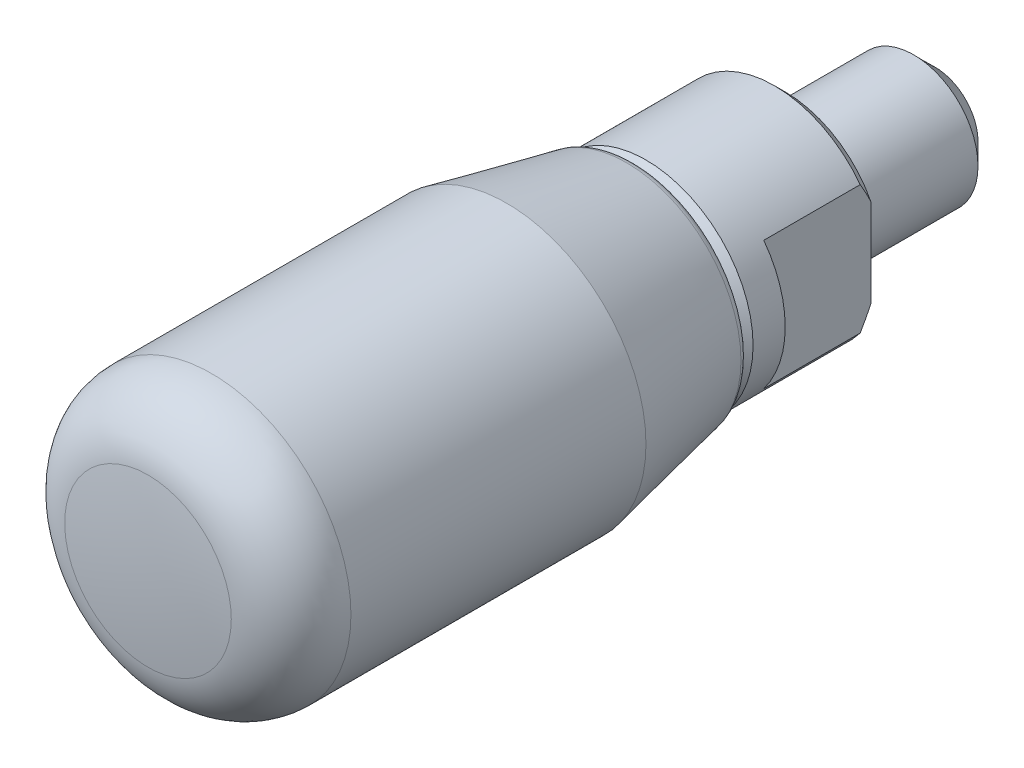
ISO-10303-21;
HEADER;
FILE_DESCRIPTION(('STEP AP214'),'2;1');
FILE_NAME('part.step','',(''),(''),'','','');
FILE_SCHEMA(('AUTOMOTIVE_DESIGN { 1 0 10303 214 1 1 1 1 }'));
ENDSEC;
DATA;
#1=APPLICATION_CONTEXT('core data for automotive mechanical design processes');
#2=APPLICATION_PROTOCOL_DEFINITION('international standard','automotive_design',2000,#1);
#3=PRODUCT_CONTEXT('',#1,'mechanical');
#4=PRODUCT('Part','Part','',(#3));
#5=PRODUCT_RELATED_PRODUCT_CATEGORY('part','',(#4));
#6=PRODUCT_DEFINITION_FORMATION('','',#4);
#7=PRODUCT_DEFINITION_CONTEXT('part definition',#1,'design');
#8=PRODUCT_DEFINITION('design','',#6,#7);
#9=PRODUCT_DEFINITION_SHAPE('','',#8);
#10=(LENGTH_UNIT() NAMED_UNIT(*) SI_UNIT(.MILLI.,.METRE.));
#11=(NAMED_UNIT(*) PLANE_ANGLE_UNIT() SI_UNIT($,.RADIAN.));
#12=(NAMED_UNIT(*) SI_UNIT($,.STERADIAN.) SOLID_ANGLE_UNIT());
#13=UNCERTAINTY_MEASURE_WITH_UNIT(LENGTH_MEASURE(1.E-05),#10,'distance_accuracy_value','');
#14=(GEOMETRIC_REPRESENTATION_CONTEXT(3) GLOBAL_UNCERTAINTY_ASSIGNED_CONTEXT((#13)) GLOBAL_UNIT_ASSIGNED_CONTEXT((#10,
#11,#12)) REPRESENTATION_CONTEXT('',''));
#15=CARTESIAN_POINT('',(0.,0.,0.));
#16=DIRECTION('',(0.,0.,1.));
#17=DIRECTION('',(1.,0.,0.));
#18=AXIS2_PLACEMENT_3D('',#15,#16,#17);
#19=CARTESIAN_POINT('',(0.,4.5,0.));
#20=DIRECTION('',(0.,0.,1.));
#21=DIRECTION('',(1.,0.,0.));
#22=AXIS2_PLACEMENT_3D('',#19,#20,#21);
#23=PLANE('',#22);
#24=CARTESIAN_POINT('',(0.,0.,0.));
#25=DIRECTION('',(0.,0.,1.));
#26=DIRECTION('',(1.,0.,0.));
#27=AXIS2_PLACEMENT_3D('',#24,#25,#26);
#28=CIRCLE('',#27,3.);
#29=CARTESIAN_POINT('',(3.,0.,0.));
#30=VERTEX_POINT('',#29);
#31=EDGE_CURVE('E92',#30,#30,#28,.T.);
#32=ORIENTED_EDGE('',*,*,#31,.T.);
#33=EDGE_LOOP('',(#32));
#34=FACE_BOUND('',#33,.T.);
#35=DIRECTION('',(0.,1.,0.));
#36=VECTOR('',#35,1.);
#37=CARTESIAN_POINT('',(-4.,3.,0.));
#38=LINE('',#37,#36);
#39=CARTESIAN_POINT('',(-4.,-2.06155281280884,0.));
#40=VERTEX_POINT('',#39);
#41=CARTESIAN_POINT('',(-4.,2.06155281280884,0.));
#42=VERTEX_POINT('',#41);
#43=EDGE_CURVE('E70',#40,#42,#38,.T.);
#44=ORIENTED_EDGE('',*,*,#43,.T.);
#45=CARTESIAN_POINT('',(0.,0.,0.));
#46=DIRECTION('',(0.,0.,1.));
#47=DIRECTION('',(1.,0.,0.));
#48=AXIS2_PLACEMENT_3D('',#45,#46,#47);
#49=CIRCLE('',#48,4.5);
#50=CARTESIAN_POINT('',(4.,2.06155281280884,0.));
#51=VERTEX_POINT('',#50);
#52=EDGE_CURVE('E95',#51,#42,#49,.T.);
#53=ORIENTED_EDGE('',*,*,#52,.F.);
#54=DIRECTION('',(0.,1.,0.));
#55=VECTOR('',#54,1.);
#56=CARTESIAN_POINT('',(4.,3.,0.));
#57=LINE('',#56,#55);
#58=CARTESIAN_POINT('',(4.,-2.06155281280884,0.));
#59=VERTEX_POINT('',#58);
#60=EDGE_CURVE('E132',#59,#51,#57,.T.);
#61=ORIENTED_EDGE('',*,*,#60,.F.);
#62=EDGE_CURVE('E98',#40,#59,#49,.T.);
#63=ORIENTED_EDGE('',*,*,#62,.F.);
#64=EDGE_LOOP('',(#44,#53,#61,#63));
#65=FACE_BOUND('',#64,.T.);
#66=ADVANCED_FACE('F14',(#34,#65),#23,.F.);
#67=CARTESIAN_POINT('',(0.,0.,0.));
#68=DIRECTION('',(0.,0.,1.));
#69=DIRECTION('',(1.,0.,0.));
#70=AXIS2_PLACEMENT_3D('',#67,#68,#69);
#71=CONICAL_SURFACE('',#70,4.5,0.785398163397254);
#72=CARTESIAN_POINT('',(-4.,6.61267837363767,3.22835786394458));
#73=CARTESIAN_POINT('',(-4.,6.5138484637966,3.14379764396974));
#74=CARTESIAN_POINT('',(-4.,6.41477027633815,3.05952756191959));
#75=CARTESIAN_POINT('',(-4.,6.21605204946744,2.89164873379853));
#76=CARTESIAN_POINT('',(-4.,6.11641199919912,2.8080400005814));
#77=CARTESIAN_POINT('',(-4.,5.81645670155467,2.55824890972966));
#78=CARTESIAN_POINT('',(-4.,5.61520522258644,2.39318656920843));
#79=CARTESIAN_POINT('',(-4.,5.2041444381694,2.06260458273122));
#80=CARTESIAN_POINT('',(-4.,4.99425007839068,1.89719028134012));
#81=CARTESIAN_POINT('',(-4.,4.5702423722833,1.57195226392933));
#82=CARTESIAN_POINT('',(-4.,4.35613010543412,1.41212714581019));
#83=CARTESIAN_POINT('',(-4.,3.92191769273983,1.09986985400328));
#84=CARTESIAN_POINT('',(-4.,3.70180729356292,0.947451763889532));
#85=CARTESIAN_POINT('',(-4.,3.36602267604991,0.727143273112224));
#86=CARTESIAN_POINT('',(-4.,3.25310127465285,0.655060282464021));
#87=CARTESIAN_POINT('',(-4.,3.025146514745,0.514324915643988));
#88=CARTESIAN_POINT('',(-4.,2.91011332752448,0.445672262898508));
#89=CARTESIAN_POINT('',(-4.,2.67874926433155,0.313189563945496));
#90=CARTESIAN_POINT('',(-4.,2.56244159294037,0.249319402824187));
#91=CARTESIAN_POINT('',(-4.,2.3271994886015,0.126638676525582));
#92=CARTESIAN_POINT('',(-4.,2.2082647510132,0.0678287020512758));
#93=CARTESIAN_POINT('',(-4.,1.84745293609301,-0.0991336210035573));
#94=CARTESIAN_POINT('',(-4.,1.60104963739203,-0.19812672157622));
#95=CARTESIAN_POINT('',(-4.,1.21869368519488,-0.320278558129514));
#96=CARTESIAN_POINT('',(-4.,1.08703991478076,-0.356945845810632));
#97=CARTESIAN_POINT('',(-4.,0.820997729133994,-0.418663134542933));
#98=CARTESIAN_POINT('',(-4.,0.686609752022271,-0.443714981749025));
#99=CARTESIAN_POINT('',(-4.,0.41663791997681,-0.48057112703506));
#100=CARTESIAN_POINT('',(-4.,0.281062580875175,-0.492436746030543));
#101=CARTESIAN_POINT('',(-4.,0.00940161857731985,-0.50229190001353));
#102=CARTESIAN_POINT('',(-4.,-0.126683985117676,-0.500281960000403));
#103=CARTESIAN_POINT('',(-4.,-0.397695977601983,-0.482550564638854));
#104=CARTESIAN_POINT('',(-4.,-0.532623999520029,-0.466853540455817));
#105=CARTESIAN_POINT('',(-4.,-0.800390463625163,-0.422848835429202));
#106=CARTESIAN_POINT('',(-4.,-0.9332285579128,-0.394539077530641));
#107=CARTESIAN_POINT('',(-4.,-1.19683850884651,-0.326742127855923));
#108=CARTESIAN_POINT('',(-4.,-1.3275928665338,-0.287187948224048));
#109=CARTESIAN_POINT('',(-4.,-1.58587707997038,-0.198805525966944));
#110=CARTESIAN_POINT('',(-4.,-1.71340705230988,-0.149977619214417));
#111=CARTESIAN_POINT('',(-4.,-2.00607339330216,-0.027712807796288));
#112=CARTESIAN_POINT('',(-4.,-2.17001221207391,0.0485725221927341));
#113=CARTESIAN_POINT('',(-4.,-2.49288824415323,0.211159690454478));
#114=CARTESIAN_POINT('',(-4.,-2.6518222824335,0.297467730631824));
#115=CARTESIAN_POINT('',(-4.,-2.96566951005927,0.477818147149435));
#116=CARTESIAN_POINT('',(-4.,-3.12057308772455,0.571877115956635));
#117=CARTESIAN_POINT('',(-4.,-3.42666836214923,0.765742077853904));
#118=CARTESIAN_POINT('',(-4.,-3.57786085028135,0.86554683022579));
#119=CARTESIAN_POINT('',(-4.,-3.87789023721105,1.07009325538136));
#120=CARTESIAN_POINT('',(-4.,-4.02671282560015,1.17485582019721));
#121=CARTESIAN_POINT('',(-4.,-4.32180408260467,1.38791783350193));
#122=CARTESIAN_POINT('',(-4.,-4.46807264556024,1.49621742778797));
#123=CARTESIAN_POINT('',(-4.,-4.75830471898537,1.71549986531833));
#124=CARTESIAN_POINT('',(-4.,-4.90227076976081,1.82647935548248));
#125=CARTESIAN_POINT('',(-4.,-5.18842229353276,2.05071313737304));
#126=CARTESIAN_POINT('',(-4.,-5.33060772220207,2.16396748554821));
#127=CARTESIAN_POINT('',(-4.,-5.66527129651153,2.4341347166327));
#128=CARTESIAN_POINT('',(-4.,-5.85710121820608,2.59184912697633));
#129=CARTESIAN_POINT('',(-4.,-6.2371217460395,2.90884826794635));
#130=CARTESIAN_POINT('',(-4.,-6.42532862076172,3.06811347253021));
#131=CARTESIAN_POINT('',(-4.,-6.61267837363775,3.2283578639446));
#132=B_SPLINE_CURVE_WITH_KNOTS('',3,(#72,#73,#74,#75,#76,#77,#78,#79,#80,#81,#82,#83,#84,#85,
#86,#87,#88,#89,#90,#91,#92,#93,#94,#95,#96,#97,#98,#99,#100,#101,#102,#103,#104,#105,#106,#107,
#108,#109,#110,#111,#112,#113,#114,#115,#116,#117,#118,#119,#120,#121,#122,#123,#124,#125,#126,
#127,#128,#129,#130,#131),.UNSPECIFIED.,.F.,.F.,(4,2,2,2,2,2,2,2,2,2,2,2,2,2,2,2,2,2,2,2,2,2,2,
2,2,2,2,2,2,4),(0.,0.39020422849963,0.780416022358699,1.56123065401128,2.36288213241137,
3.16433104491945,3.9672485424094,4.3691011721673,4.770921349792,5.16886742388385,
5.56685988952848,6.36104037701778,6.77061720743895,7.18012891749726,7.58772816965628,
7.99531199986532,8.40216978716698,8.80909460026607,9.21849635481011,9.62788328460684,
10.1698609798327,10.7121758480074,11.2556834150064,11.7990740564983,12.3450041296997,
12.8909567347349,13.4362584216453,13.9815736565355,14.7265631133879,15.4661801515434),.UNSPECIFIED.);
#133=CARTESIAN_POINT('',(-4.,3.,0.50000000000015));
#134=VERTEX_POINT('',#133);
#135=EDGE_CURVE('E322',#134,#42,#132,.T.);
#136=ORIENTED_EDGE('',*,*,#135,.F.);
#137=CARTESIAN_POINT('',(0.,0.,0.50000000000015));
#138=DIRECTION('',(0.,0.,1.));
#139=DIRECTION('',(1.,0.,0.));
#140=AXIS2_PLACEMENT_3D('',#137,#138,#139);
#141=CIRCLE('',#140,5.);
#142=CARTESIAN_POINT('',(4.,3.,0.50000000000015));
#143=VERTEX_POINT('',#142);
#144=EDGE_CURVE('E99',#143,#134,#141,.T.);
#145=ORIENTED_EDGE('',*,*,#144,.F.);
#146=CARTESIAN_POINT('',(4.,-6.61267837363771,3.22835786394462));
#147=CARTESIAN_POINT('',(4.,-6.51384846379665,3.14379764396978));
#148=CARTESIAN_POINT('',(4.,-6.4147702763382,3.05952756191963));
#149=CARTESIAN_POINT('',(4.,-6.21605204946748,2.89164873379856));
#150=CARTESIAN_POINT('',(4.,-6.11641199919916,2.80804000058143));
#151=CARTESIAN_POINT('',(4.,-5.81645670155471,2.55824890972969));
#152=CARTESIAN_POINT('',(4.,-5.61520522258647,2.39318656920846));
#153=CARTESIAN_POINT('',(4.,-5.20414443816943,2.06260458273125));
#154=CARTESIAN_POINT('',(4.,-4.99425007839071,1.89719028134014));
#155=CARTESIAN_POINT('',(4.,-4.57024237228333,1.57195226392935));
#156=CARTESIAN_POINT('',(4.,-4.35613010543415,1.41212714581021));
#157=CARTESIAN_POINT('',(4.,-3.92191769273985,1.0998698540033));
#158=CARTESIAN_POINT('',(4.,-3.70180729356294,0.947451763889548));
#159=CARTESIAN_POINT('',(4.,-3.36602267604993,0.727143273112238));
#160=CARTESIAN_POINT('',(4.,-3.25310127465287,0.655060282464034));
#161=CARTESIAN_POINT('',(4.,-3.02514651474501,0.514324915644));
#162=CARTESIAN_POINT('',(4.,-2.9101133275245,0.445672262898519));
#163=CARTESIAN_POINT('',(4.,-2.67874926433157,0.313189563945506));
#164=CARTESIAN_POINT('',(4.,-2.56244159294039,0.249319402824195));
#165=CARTESIAN_POINT('',(4.,-2.32719948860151,0.12663867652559));
#166=CARTESIAN_POINT('',(4.,-2.20826475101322,0.0678287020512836));
#167=CARTESIAN_POINT('',(4.,-1.84745293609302,-0.0991336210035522));
#168=CARTESIAN_POINT('',(4.,-1.60104963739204,-0.19812672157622));
#169=CARTESIAN_POINT('',(4.,-1.2186936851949,-0.320278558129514));
#170=CARTESIAN_POINT('',(4.,-1.08703991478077,-0.35694584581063));
#171=CARTESIAN_POINT('',(4.,-0.820997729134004,-0.41866313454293));
#172=CARTESIAN_POINT('',(4.,-0.686609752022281,-0.443714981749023));
#173=CARTESIAN_POINT('',(4.,-0.41663791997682,-0.480571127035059));
#174=CARTESIAN_POINT('',(4.,-0.281062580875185,-0.492436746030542));
#175=CARTESIAN_POINT('',(4.,-0.00940161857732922,-0.50229190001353));
#176=CARTESIAN_POINT('',(4.,0.126683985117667,-0.500281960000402));
#177=CARTESIAN_POINT('',(4.,0.397695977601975,-0.482550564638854));
#178=CARTESIAN_POINT('',(4.,0.532623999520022,-0.466853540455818));
#179=CARTESIAN_POINT('',(4.,0.800390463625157,-0.422848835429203));
#180=CARTESIAN_POINT('',(4.,0.933228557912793,-0.394539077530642));
#181=CARTESIAN_POINT('',(4.,1.19683850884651,-0.326742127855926));
#182=CARTESIAN_POINT('',(4.,1.32759286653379,-0.287187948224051));
#183=CARTESIAN_POINT('',(4.,1.58587707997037,-0.198805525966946));
#184=CARTESIAN_POINT('',(4.,1.71340705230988,-0.149977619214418));
#185=CARTESIAN_POINT('',(4.,2.00607339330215,-0.0277128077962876));
#186=CARTESIAN_POINT('',(4.,2.1700122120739,0.0485725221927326));
#187=CARTESIAN_POINT('',(4.,2.49288824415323,0.211159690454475));
#188=CARTESIAN_POINT('',(4.,2.6518222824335,0.297467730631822));
#189=CARTESIAN_POINT('',(4.,2.96566951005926,0.477818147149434));
#190=CARTESIAN_POINT('',(4.,3.12057308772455,0.571877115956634));
#191=CARTESIAN_POINT('',(4.,3.42666836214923,0.765742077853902));
#192=CARTESIAN_POINT('',(4.,3.57786085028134,0.865546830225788));
#193=CARTESIAN_POINT('',(4.,3.87789023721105,1.07009325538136));
#194=CARTESIAN_POINT('',(4.,4.02671282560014,1.1748558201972));
#195=CARTESIAN_POINT('',(4.,4.32180408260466,1.38791783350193));
#196=CARTESIAN_POINT('',(4.,4.46807264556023,1.49621742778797));
#197=CARTESIAN_POINT('',(4.,4.75830471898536,1.71549986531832));
#198=CARTESIAN_POINT('',(4.,4.9022707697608,1.82647935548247));
#199=CARTESIAN_POINT('',(4.,5.18842229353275,2.05071313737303));
#200=CARTESIAN_POINT('',(4.,5.33060772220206,2.16396748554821));
#201=CARTESIAN_POINT('',(4.,5.66527129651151,2.43413471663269));
#202=CARTESIAN_POINT('',(4.,5.85710121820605,2.59184912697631));
#203=CARTESIAN_POINT('',(4.,6.23712174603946,2.90884826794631));
#204=CARTESIAN_POINT('',(4.,6.42532862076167,3.06811347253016));
#205=CARTESIAN_POINT('',(4.,6.61267837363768,3.22835786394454));
#206=B_SPLINE_CURVE_WITH_KNOTS('',3,(#146,#147,#148,#149,#150,#151,#152,#153,#154,#155,#156,
#157,#158,#159,#160,#161,#162,#163,#164,#165,#166,#167,#168,#169,#170,#171,#172,#173,#174,#175,
#176,#177,#178,#179,#180,#181,#182,#183,#184,#185,#186,#187,#188,#189,#190,#191,#192,#193,#194,
#195,#196,#197,#198,#199,#200,#201,#202,#203,#204,#205),.UNSPECIFIED.,.F.,.F.,(4,2,2,2,2,2,2,2,
2,2,2,2,2,2,2,2,2,2,2,2,2,2,2,2,2,2,2,2,2,4),(0.,0.390204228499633,0.780416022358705,
1.56123065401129,2.36288213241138,3.16433104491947,3.96724854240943,4.36910117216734,
4.77092134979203,5.16886742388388,5.56685988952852,6.36104037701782,6.770617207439,
7.18012891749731,7.58772816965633,7.99531199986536,8.40216978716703,8.80909460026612,
9.21849635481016,9.62788328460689,10.1698609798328,10.7121758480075,11.2556834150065,
11.7990740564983,12.3450041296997,12.8909567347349,13.4362584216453,13.9815736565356,
14.7265631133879,15.4661801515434),.UNSPECIFIED.);
#207=EDGE_CURVE('E124',#51,#143,#206,.T.);
#208=ORIENTED_EDGE('',*,*,#207,.F.);
#209=ORIENTED_EDGE('',*,*,#52,.T.);
#210=EDGE_LOOP('',(#136,#145,#208,#209));
#211=FACE_BOUND('',#210,.T.);
#212=ADVANCED_FACE('F134',(#211),#71,.T.);
#213=CARTESIAN_POINT('',(-4.,-3.,0.50000000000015));
#214=VERTEX_POINT('',#213);
#215=EDGE_CURVE('E75',#40,#214,#132,.T.);
#216=ORIENTED_EDGE('',*,*,#215,.F.);
#217=ORIENTED_EDGE('',*,*,#62,.T.);
#218=CARTESIAN_POINT('',(4.,-3.,0.50000000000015));
#219=VERTEX_POINT('',#218);
#220=EDGE_CURVE('E123',#219,#59,#206,.T.);
#221=ORIENTED_EDGE('',*,*,#220,.F.);
#222=EDGE_CURVE('E101',#214,#219,#141,.T.);
#223=ORIENTED_EDGE('',*,*,#222,.F.);
#224=EDGE_LOOP('',(#216,#217,#221,#223));
#225=FACE_BOUND('',#224,.T.);
#226=ADVANCED_FACE('F173',(#225),#71,.T.);
#227=CARTESIAN_POINT('',(0.,0.,32.5));
#228=DIRECTION('',(0.,0.,1.));
#229=DIRECTION('',(1.,0.,0.));
#230=AXIS2_PLACEMENT_3D('',#227,#228,#229);
#231=CYLINDRICAL_SURFACE('',#230,5.);
#232=CARTESIAN_POINT('',(0.,0.,6.5));
#233=DIRECTION('',(0.,0.,1.));
#234=DIRECTION('',(1.,0.,0.));
#235=AXIS2_PLACEMENT_3D('',#232,#233,#234);
#236=CIRCLE('',#235,5.);
#237=CARTESIAN_POINT('',(5.,0.,6.5));
#238=VERTEX_POINT('',#237);
#239=EDGE_CURVE('E102',#238,#238,#236,.T.);
#240=ORIENTED_EDGE('',*,*,#239,.F.);
#241=EDGE_LOOP('',(#240));
#242=FACE_BOUND('',#241,.T.);
#243=DIRECTION('',(0.,0.,1.));
#244=VECTOR('',#243,1.);
#245=CARTESIAN_POINT('',(-4.,2.99999999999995,32.5));
#246=LINE('',#245,#244);
#247=CARTESIAN_POINT('',(-4.,2.99999999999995,5.00000000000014));
#248=VERTEX_POINT('',#247);
#249=EDGE_CURVE('E9',#248,#134,#246,.F.);
#250=ORIENTED_EDGE('',*,*,#249,.F.);
#251=CARTESIAN_POINT('',(0.,0.,5.00000000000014));
#252=DIRECTION('',(0.,0.,-1.));
#253=DIRECTION('',(-1.,0.,0.));
#254=AXIS2_PLACEMENT_3D('',#251,#252,#253);
#255=CIRCLE('',#254,5.);
#256=CARTESIAN_POINT('',(-4.,-3.,5.00000000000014));
#257=VERTEX_POINT('',#256);
#258=EDGE_CURVE('E22',#257,#248,#255,.T.);
#259=ORIENTED_EDGE('',*,*,#258,.F.);
#260=DIRECTION('',(0.,0.,-1.));
#261=VECTOR('',#260,1.);
#262=CARTESIAN_POINT('',(-4.,-3.,0.));
#263=LINE('',#262,#261);
#264=EDGE_CURVE('E69',#257,#214,#263,.T.);
#265=ORIENTED_EDGE('',*,*,#264,.T.);
#266=ORIENTED_EDGE('',*,*,#222,.T.);
#267=DIRECTION('',(0.,0.,-1.));
#268=VECTOR('',#267,1.);
#269=CARTESIAN_POINT('',(4.,-3.,5.00000000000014));
#270=LINE('',#269,#268);
#271=CARTESIAN_POINT('',(3.99999999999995,-3.,5.00000000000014));
#272=VERTEX_POINT('',#271);
#273=EDGE_CURVE('E323',#272,#219,#270,.T.);
#274=ORIENTED_EDGE('',*,*,#273,.F.);
#275=CARTESIAN_POINT('',(0.,0.,5.00000000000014));
#276=DIRECTION('',(0.,0.,1.));
#277=DIRECTION('',(1.,0.,0.));
#278=AXIS2_PLACEMENT_3D('',#275,#276,#277);
#279=CIRCLE('',#278,5.);
#280=CARTESIAN_POINT('',(4.,3.,5.00000000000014));
#281=VERTEX_POINT('',#280);
#282=EDGE_CURVE('E82',#272,#281,#279,.T.);
#283=ORIENTED_EDGE('',*,*,#282,.T.);
#284=DIRECTION('',(0.,0.,1.));
#285=VECTOR('',#284,1.);
#286=CARTESIAN_POINT('',(4.,2.99999999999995,32.5));
#287=LINE('',#286,#285);
#288=EDGE_CURVE('E81',#143,#281,#287,.T.);
#289=ORIENTED_EDGE('',*,*,#288,.F.);
#290=ORIENTED_EDGE('',*,*,#144,.T.);
#291=EDGE_LOOP('',(#250,#259,#265,#266,#274,#283,#289,#290));
#292=FACE_BOUND('',#291,.T.);
#293=ADVANCED_FACE('F79',(#242,#292),#231,.T.);
#294=CARTESIAN_POINT('',(0.,0.,0.));
#295=DIRECTION('',(0.,0.,1.));
#296=DIRECTION('',(0.,1.,0.));
#297=AXIS2_PLACEMENT_3D('',#294,#295,#296);
#298=SPHERICAL_SURFACE('',#297,30.);
#299=CARTESIAN_POINT('',(0.,0.,29.7468745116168));
#300=DIRECTION('',(0.,0.,1.));
#301=DIRECTION('',(1.,0.,0.));
#302=AXIS2_PLACEMENT_3D('',#299,#300,#301);
#303=CIRCLE('',#302,3.88888888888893);
#304=CARTESIAN_POINT('',(3.88888888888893,0.,29.7468745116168));
#305=VERTEX_POINT('',#304);
#306=EDGE_CURVE('E120',#305,#305,#303,.T.);
#307=ORIENTED_EDGE('',*,*,#306,.T.);
#308=EDGE_LOOP('',(#307));
#309=FACE_BOUND('',#308,.T.);
#310=ADVANCED_FACE('F16',(#309),#298,.T.);
#311=CARTESIAN_POINT('',(0.,2.,-7.));
#312=DIRECTION('',(0.,0.,1.));
#313=DIRECTION('',(1.,0.,0.));
#314=AXIS2_PLACEMENT_3D('',#311,#312,#313);
#315=PLANE('',#314);
#316=CARTESIAN_POINT('',(0.,0.,-7.));
#317=DIRECTION('',(0.,0.,1.));
#318=DIRECTION('',(1.,0.,0.));
#319=AXIS2_PLACEMENT_3D('',#316,#317,#318);
#320=CIRCLE('',#319,2.);
#321=CARTESIAN_POINT('',(2.,0.,-7.));
#322=VERTEX_POINT('',#321);
#323=EDGE_CURVE('E86',#322,#322,#320,.T.);
#324=ORIENTED_EDGE('',*,*,#323,.F.);
#325=EDGE_LOOP('',(#324));
#326=FACE_BOUND('',#325,.T.);
#327=ADVANCED_FACE('F181',(#326),#315,.F.);
#328=CARTESIAN_POINT('',(0.,0.,-7.));
#329=DIRECTION('',(0.,0.,1.));
#330=DIRECTION('',(1.,0.,0.));
#331=AXIS2_PLACEMENT_3D('',#328,#329,#330);
#332=CONICAL_SURFACE('',#331,2.,0.785398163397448);
#333=CARTESIAN_POINT('',(0.,0.,-6.));
#334=DIRECTION('',(0.,0.,1.));
#335=DIRECTION('',(1.,0.,0.));
#336=AXIS2_PLACEMENT_3D('',#333,#334,#335);
#337=CIRCLE('',#336,3.);
#338=CARTESIAN_POINT('',(3.,0.,-6.));
#339=VERTEX_POINT('',#338);
#340=EDGE_CURVE('E89',#339,#339,#337,.T.);
#341=ORIENTED_EDGE('',*,*,#340,.F.);
#342=EDGE_LOOP('',(#341));
#343=FACE_BOUND('',#342,.T.);
#344=ORIENTED_EDGE('',*,*,#323,.T.);
#345=EDGE_LOOP('',(#344));
#346=FACE_BOUND('',#345,.T.);
#347=ADVANCED_FACE('F196',(#343,#346),#332,.T.);
#348=CARTESIAN_POINT('',(0.,0.,32.5));
#349=DIRECTION('',(0.,0.,1.));
#350=DIRECTION('',(1.,0.,0.));
#351=AXIS2_PLACEMENT_3D('',#348,#349,#350);
#352=CYLINDRICAL_SURFACE('',#351,3.);
#353=ORIENTED_EDGE('',*,*,#31,.F.);
#354=EDGE_LOOP('',(#353));
#355=FACE_BOUND('',#354,.T.);
#356=ORIENTED_EDGE('',*,*,#340,.T.);
#357=EDGE_LOOP('',(#356));
#358=FACE_BOUND('',#357,.T.);
#359=ADVANCED_FACE('F170',(#355,#358),#352,.T.);
#360=CARTESIAN_POINT('',(0.,0.,6.5));
#361=DIRECTION('',(0.,0.,-1.));
#362=DIRECTION('',(-1.,0.,0.));
#363=AXIS2_PLACEMENT_3D('',#360,#361,#362);
#364=CONICAL_SURFACE('',#363,5.,0.785398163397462);
#365=CARTESIAN_POINT('',(0.,0.,7.));
#366=DIRECTION('',(0.,0.,1.));
#367=DIRECTION('',(1.,0.,0.));
#368=AXIS2_PLACEMENT_3D('',#365,#366,#367);
#369=CIRCLE('',#368,4.49999999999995);
#370=CARTESIAN_POINT('',(4.49999999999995,0.,7.));
#371=VERTEX_POINT('',#370);
#372=EDGE_CURVE('E105',#371,#371,#369,.T.);
#373=ORIENTED_EDGE('',*,*,#372,.F.);
#374=EDGE_LOOP('',(#373));
#375=FACE_BOUND('',#374,.T.);
#376=ORIENTED_EDGE('',*,*,#239,.T.);
#377=EDGE_LOOP('',(#376));
#378=FACE_BOUND('',#377,.T.);
#379=ADVANCED_FACE('F167',(#375,#378),#364,.T.);
#380=CARTESIAN_POINT('',(0.,4.84343122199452,7.));
#381=DIRECTION('',(0.,0.,1.));
#382=DIRECTION('',(1.,0.,0.));
#383=AXIS2_PLACEMENT_3D('',#380,#381,#382);
#384=PLANE('',#383);
#385=CARTESIAN_POINT('',(0.,0.,7.));
#386=DIRECTION('',(0.,0.,1.));
#387=DIRECTION('',(1.,0.,0.));
#388=AXIS2_PLACEMENT_3D('',#385,#386,#387);
#389=CIRCLE('',#388,4.84343122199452);
#390=CARTESIAN_POINT('',(4.84343122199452,0.,7.));
#391=VERTEX_POINT('',#390);
#392=EDGE_CURVE('E108',#391,#391,#389,.T.);
#393=ORIENTED_EDGE('',*,*,#392,.F.);
#394=EDGE_LOOP('',(#393));
#395=FACE_BOUND('',#394,.T.);
#396=ORIENTED_EDGE('',*,*,#372,.T.);
#397=EDGE_LOOP('',(#396));
#398=FACE_BOUND('',#397,.T.);
#399=ADVANCED_FACE('F163',(#395,#398),#384,.F.);
#400=CARTESIAN_POINT('',(0.,0.,7.5));
#401=DIRECTION('',(0.,0.,1.));
#402=DIRECTION('',(1.,0.,0.));
#403=AXIS2_PLACEMENT_3D('',#400,#401,#402);
#404=TOROIDAL_SURFACE('',#403,4.84343122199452,0.500000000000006);
#405=CARTESIAN_POINT('',(0.,0.,7.39802287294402));
#406=DIRECTION('',(0.,0.,1.));
#407=DIRECTION('',(1.,0.,0.));
#408=AXIS2_PLACEMENT_3D('',#405,#406,#407);
#409=CIRCLE('',#408,5.33292143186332);
#410=CARTESIAN_POINT('',(5.33292143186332,0.,7.39802287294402));
#411=VERTEX_POINT('',#410);
#412=EDGE_CURVE('E111',#411,#411,#409,.T.);
#413=ORIENTED_EDGE('',*,*,#412,.F.);
#414=EDGE_LOOP('',(#413));
#415=FACE_BOUND('',#414,.T.);
#416=ORIENTED_EDGE('',*,*,#392,.T.);
#417=EDGE_LOOP('',(#416));
#418=FACE_BOUND('',#417,.T.);
#419=ADVANCED_FACE('F159',(#415,#418),#404,.T.);
#420=CARTESIAN_POINT('',(0.,0.,7.39802287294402));
#421=DIRECTION('',(0.,0.,1.));
#422=DIRECTION('',(1.,0.,0.));
#423=AXIS2_PLACEMENT_3D('',#420,#421,#422);
#424=CONICAL_SURFACE('',#423,5.33292143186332,0.20539538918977);
#425=CARTESIAN_POINT('',(0.,0.,13.));
#426=DIRECTION('',(0.,0.,1.));
#427=DIRECTION('',(1.,0.,0.));
#428=AXIS2_PLACEMENT_3D('',#425,#426,#427);
#429=CIRCLE('',#428,6.5);
#430=CARTESIAN_POINT('',(6.5,0.,13.));
#431=VERTEX_POINT('',#430);
#432=EDGE_CURVE('E114',#431,#431,#429,.T.);
#433=ORIENTED_EDGE('',*,*,#432,.F.);
#434=EDGE_LOOP('',(#433));
#435=FACE_BOUND('',#434,.T.);
#436=ORIENTED_EDGE('',*,*,#412,.T.);
#437=EDGE_LOOP('',(#436));
#438=FACE_BOUND('',#437,.T.);
#439=ADVANCED_FACE('F155',(#435,#438),#424,.T.);
#440=CARTESIAN_POINT('',(0.,0.,32.5));
#441=DIRECTION('',(0.,0.,1.));
#442=DIRECTION('',(1.,0.,0.));
#443=AXIS2_PLACEMENT_3D('',#440,#441,#442);
#444=CYLINDRICAL_SURFACE('',#443,6.5);
#445=CARTESIAN_POINT('',(0.,0.,26.7721870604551));
#446=DIRECTION('',(0.,0.,1.));
#447=DIRECTION('',(1.,0.,0.));
#448=AXIS2_PLACEMENT_3D('',#445,#446,#447);
#449=CIRCLE('',#448,6.5);
#450=CARTESIAN_POINT('',(6.5,0.,26.7721870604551));
#451=VERTEX_POINT('',#450);
#452=EDGE_CURVE('E117',#451,#451,#449,.T.);
#453=ORIENTED_EDGE('',*,*,#452,.F.);
#454=EDGE_LOOP('',(#453));
#455=FACE_BOUND('',#454,.T.);
#456=ORIENTED_EDGE('',*,*,#432,.T.);
#457=EDGE_LOOP('',(#456));
#458=FACE_BOUND('',#457,.T.);
#459=ADVANCED_FACE('F151',(#455,#458),#444,.T.);
#460=CARTESIAN_POINT('',(0.,0.,26.7721870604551));
#461=DIRECTION('',(0.,0.,1.));
#462=DIRECTION('',(1.,0.,0.));
#463=AXIS2_PLACEMENT_3D('',#460,#461,#462);
#464=TOROIDAL_SURFACE('',#463,3.5,3.);
#465=ORIENTED_EDGE('',*,*,#306,.F.);
#466=EDGE_LOOP('',(#465));
#467=FACE_BOUND('',#466,.T.);
#468=ORIENTED_EDGE('',*,*,#452,.T.);
#469=EDGE_LOOP('',(#468));
#470=FACE_BOUND('',#469,.T.);
#471=ADVANCED_FACE('F147',(#467,#470),#464,.T.);
#472=CARTESIAN_POINT('',(4.,3.,5.00000000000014));
#473=DIRECTION('',(0.,0.,1.));
#474=DIRECTION('',(1.,0.,0.));
#475=AXIS2_PLACEMENT_3D('',#472,#473,#474);
#476=PLANE('',#475);
#477=ORIENTED_EDGE('',*,*,#282,.F.);
#478=DIRECTION('',(0.,-1.,0.));
#479=VECTOR('',#478,1.);
#480=CARTESIAN_POINT('',(4.,3.,5.00000000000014));
#481=LINE('',#480,#479);
#482=EDGE_CURVE('E35',#281,#272,#481,.T.);
#483=ORIENTED_EDGE('',*,*,#482,.F.);
#484=EDGE_LOOP('',(#477,#483));
#485=FACE_BOUND('',#484,.T.);
#486=ADVANCED_FACE('F143',(#485),#476,.F.);
#487=CARTESIAN_POINT('',(4.,-3.,5.00000000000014));
#488=DIRECTION('',(1.,0.,0.));
#489=DIRECTION('',(0.,0.,-1.));
#490=AXIS2_PLACEMENT_3D('',#487,#488,#489);
#491=PLANE('',#490);
#492=ORIENTED_EDGE('',*,*,#220,.T.);
#493=ORIENTED_EDGE('',*,*,#60,.T.);
#494=ORIENTED_EDGE('',*,*,#207,.T.);
#495=ORIENTED_EDGE('',*,*,#288,.T.);
#496=ORIENTED_EDGE('',*,*,#482,.T.);
#497=ORIENTED_EDGE('',*,*,#273,.T.);
#498=EDGE_LOOP('',(#492,#493,#494,#495,#496,#497));
#499=FACE_BOUND('',#498,.T.);
#500=ADVANCED_FACE('F138',(#499),#491,.T.);
#501=CARTESIAN_POINT('',(-4.,3.,5.00000000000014));
#502=DIRECTION('',(0.,0.,-1.));
#503=DIRECTION('',(-1.,0.,0.));
#504=AXIS2_PLACEMENT_3D('',#501,#502,#503);
#505=PLANE('',#504);
#506=ORIENTED_EDGE('',*,*,#258,.T.);
#507=DIRECTION('',(0.,-1.,0.));
#508=VECTOR('',#507,1.);
#509=CARTESIAN_POINT('',(-4.,3.,5.00000000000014));
#510=LINE('',#509,#508);
#511=EDGE_CURVE('E64',#248,#257,#510,.T.);
#512=ORIENTED_EDGE('',*,*,#511,.T.);
#513=EDGE_LOOP('',(#506,#512));
#514=FACE_BOUND('',#513,.T.);
#515=ADVANCED_FACE('F66',(#514),#505,.T.);
#516=CARTESIAN_POINT('',(-4.,3.,0.));
#517=DIRECTION('',(-1.,0.,0.));
#518=DIRECTION('',(0.,0.,1.));
#519=AXIS2_PLACEMENT_3D('',#516,#517,#518);
#520=PLANE('',#519);
#521=ORIENTED_EDGE('',*,*,#135,.T.);
#522=ORIENTED_EDGE('',*,*,#43,.F.);
#523=ORIENTED_EDGE('',*,*,#215,.T.);
#524=ORIENTED_EDGE('',*,*,#264,.F.);
#525=ORIENTED_EDGE('',*,*,#511,.F.);
#526=ORIENTED_EDGE('',*,*,#249,.T.);
#527=EDGE_LOOP('',(#521,#522,#523,#524,#525,#526));
#528=FACE_BOUND('',#527,.T.);
#529=ADVANCED_FACE('F73',(#528),#520,.T.);
#530=CLOSED_SHELL('',(#66,#212,#226,#293,#310,#327,#347,#359,#379,#399,#419,#439,#459,#471,#486,
#500,#515,#529));
#531=MANIFOLD_SOLID_BREP('B1',#530);
#532=ADVANCED_BREP_SHAPE_REPRESENTATION('',(#18,#531),#14);
#533=SHAPE_DEFINITION_REPRESENTATION(#9,#532);
ENDSEC;
END-ISO-10303-21;
